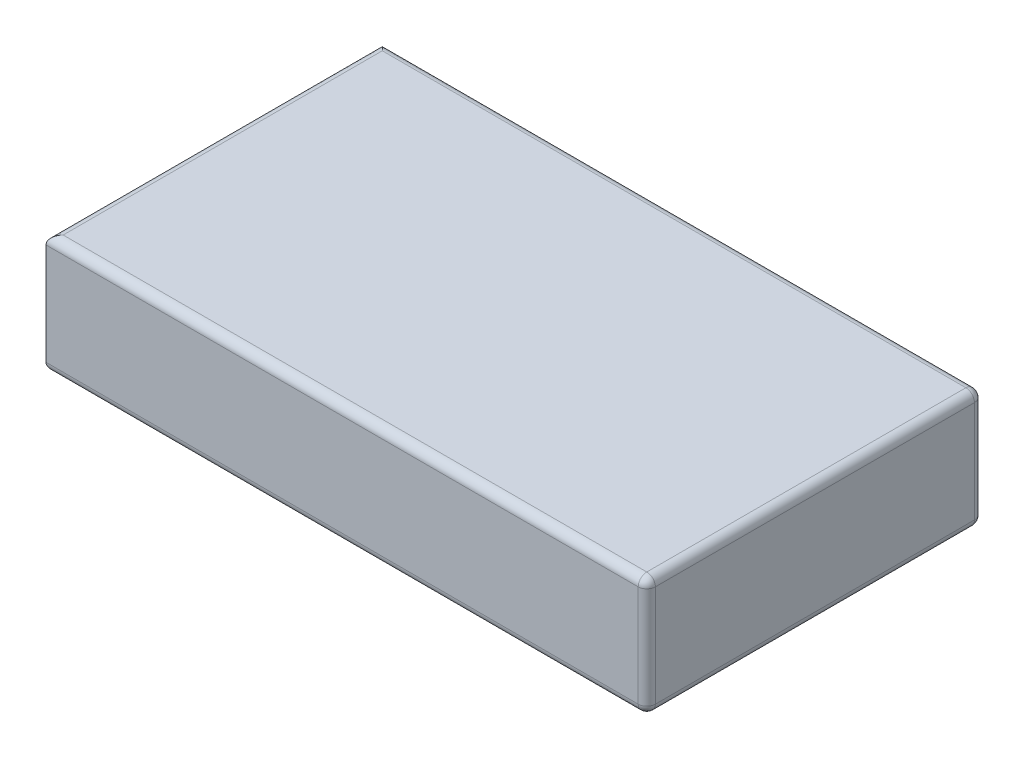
ISO-10303-21;
HEADER;
FILE_DESCRIPTION(('STEP AP214'),'2;1');
FILE_NAME('part.step','',(''),(''),'','','');
FILE_SCHEMA(('AUTOMOTIVE_DESIGN { 1 0 10303 214 1 1 1 1 }'));
ENDSEC;
DATA;
#1=APPLICATION_CONTEXT('core data for automotive mechanical design processes');
#2=APPLICATION_PROTOCOL_DEFINITION('international standard','automotive_design',2000,#1);
#3=PRODUCT_CONTEXT('',#1,'mechanical');
#4=PRODUCT('Part','Part','',(#3));
#5=PRODUCT_RELATED_PRODUCT_CATEGORY('part','',(#4));
#6=PRODUCT_DEFINITION_FORMATION('','',#4);
#7=PRODUCT_DEFINITION_CONTEXT('part definition',#1,'design');
#8=PRODUCT_DEFINITION('design','',#6,#7);
#9=PRODUCT_DEFINITION_SHAPE('','',#8);
#10=(LENGTH_UNIT() NAMED_UNIT(*) SI_UNIT(.MILLI.,.METRE.));
#11=(NAMED_UNIT(*) PLANE_ANGLE_UNIT() SI_UNIT($,.RADIAN.));
#12=(NAMED_UNIT(*) SI_UNIT($,.STERADIAN.) SOLID_ANGLE_UNIT());
#13=UNCERTAINTY_MEASURE_WITH_UNIT(LENGTH_MEASURE(1.E-05),#10,'distance_accuracy_value','');
#14=(GEOMETRIC_REPRESENTATION_CONTEXT(3) GLOBAL_UNCERTAINTY_ASSIGNED_CONTEXT((#13)) GLOBAL_UNIT_ASSIGNED_CONTEXT((#10,
#11,#12)) REPRESENTATION_CONTEXT('',''));
#15=CARTESIAN_POINT('',(0.,0.,0.));
#16=DIRECTION('',(0.,0.,1.));
#17=DIRECTION('',(1.,0.,0.));
#18=AXIS2_PLACEMENT_3D('',#15,#16,#17);
#19=CARTESIAN_POINT('',(35.,3.46,-9.795));
#20=DIRECTION('',(0.,0.,1.));
#21=DIRECTION('',(1.,0.,0.));
#22=AXIS2_PLACEMENT_3D('',#19,#20,#21);
#23=PLANE('',#22);
#24=DIRECTION('',(0.,1.,0.));
#25=VECTOR('',#24,1.);
#26=CARTESIAN_POINT('',(34.5,-3.46,-9.795));
#27=LINE('',#26,#25);
#28=CARTESIAN_POINT('',(34.5,2.96,-9.795));
#29=VERTEX_POINT('',#28);
#30=CARTESIAN_POINT('',(34.5,-2.96,-9.795));
#31=VERTEX_POINT('',#30);
#32=EDGE_CURVE('E128',#29,#31,#27,.F.);
#33=ORIENTED_EDGE('',*,*,#32,.T.);
#34=DIRECTION('',(-1.,0.,0.));
#35=VECTOR('',#34,1.);
#36=CARTESIAN_POINT('',(35.,-2.96,-9.795));
#37=LINE('',#36,#35);
#38=CARTESIAN_POINT('',(0.,-2.96,-9.795));
#39=VERTEX_POINT('',#38);
#40=EDGE_CURVE('E165',#31,#39,#37,.T.);
#41=ORIENTED_EDGE('',*,*,#40,.T.);
#42=DIRECTION('',(0.,1.,0.));
#43=VECTOR('',#42,1.);
#44=CARTESIAN_POINT('',(0.,3.46,-9.795));
#45=LINE('',#44,#43);
#46=CARTESIAN_POINT('',(0.,2.96,-9.795));
#47=VERTEX_POINT('',#46);
#48=EDGE_CURVE('E149',#39,#47,#45,.T.);
#49=ORIENTED_EDGE('',*,*,#48,.T.);
#50=DIRECTION('',(-1.,0.,0.));
#51=VECTOR('',#50,1.);
#52=CARTESIAN_POINT('',(35.,2.96,-9.795));
#53=LINE('',#52,#51);
#54=EDGE_CURVE('E162',#47,#29,#53,.F.);
#55=ORIENTED_EDGE('',*,*,#54,.T.);
#56=EDGE_LOOP('',(#33,#41,#49,#55));
#57=FACE_BOUND('',#56,.T.);
#58=ADVANCED_FACE('F34',(#57),#23,.F.);
#59=CARTESIAN_POINT('',(35.,3.46,9.795));
#60=DIRECTION('',(0.,-1.,0.));
#61=DIRECTION('',(0.,0.,-1.));
#62=AXIS2_PLACEMENT_3D('',#59,#60,#61);
#63=PLANE('',#62);
#64=DIRECTION('',(0.,0.,1.));
#65=VECTOR('',#64,1.);
#66=CARTESIAN_POINT('',(34.5,3.46,-9.795));
#67=LINE('',#66,#65);
#68=CARTESIAN_POINT('',(34.5,3.46,9.295));
#69=VERTEX_POINT('',#68);
#70=CARTESIAN_POINT('',(34.5,3.46,-9.295));
#71=VERTEX_POINT('',#70);
#72=EDGE_CURVE('E43',#69,#71,#67,.F.);
#73=ORIENTED_EDGE('',*,*,#72,.T.);
#74=DIRECTION('',(-1.,0.,0.));
#75=VECTOR('',#74,1.);
#76=CARTESIAN_POINT('',(35.,3.46,-9.295));
#77=LINE('',#76,#75);
#78=CARTESIAN_POINT('',(0.5,3.46,-9.295));
#79=VERTEX_POINT('',#78);
#80=EDGE_CURVE('E11',#71,#79,#77,.T.);
#81=ORIENTED_EDGE('',*,*,#80,.T.);
#82=DIRECTION('',(0.,0.,1.));
#83=VECTOR('',#82,1.);
#84=CARTESIAN_POINT('',(0.5,3.46,9.795));
#85=LINE('',#84,#83);
#86=CARTESIAN_POINT('',(0.5,3.46,9.295));
#87=VERTEX_POINT('',#86);
#88=EDGE_CURVE('E180',#79,#87,#85,.T.);
#89=ORIENTED_EDGE('',*,*,#88,.T.);
#90=DIRECTION('',(-1.,0.,0.));
#91=VECTOR('',#90,1.);
#92=CARTESIAN_POINT('',(35.,3.46,9.295));
#93=LINE('',#92,#91);
#94=EDGE_CURVE('E54',#87,#69,#93,.F.);
#95=ORIENTED_EDGE('',*,*,#94,.T.);
#96=EDGE_LOOP('',(#73,#81,#89,#95));
#97=FACE_BOUND('',#96,.T.);
#98=ADVANCED_FACE('F236',(#97),#63,.F.);
#99=CARTESIAN_POINT('',(35.,3.46,9.795));
#100=DIRECTION('',(0.,0.,-1.));
#101=DIRECTION('',(0.,1.,0.));
#102=AXIS2_PLACEMENT_3D('',#99,#100,#101);
#103=PLANE('',#102);
#104=DIRECTION('',(0.,-1.,0.));
#105=VECTOR('',#104,1.);
#106=CARTESIAN_POINT('',(0.,3.46,9.795));
#107=LINE('',#106,#105);
#108=CARTESIAN_POINT('',(0.,2.96,9.795));
#109=VERTEX_POINT('',#108);
#110=CARTESIAN_POINT('',(0.,-2.96,9.795));
#111=VERTEX_POINT('',#110);
#112=EDGE_CURVE('E146',#109,#111,#107,.T.);
#113=ORIENTED_EDGE('',*,*,#112,.T.);
#114=DIRECTION('',(-1.,0.,0.));
#115=VECTOR('',#114,1.);
#116=CARTESIAN_POINT('',(35.,-2.96,9.795));
#117=LINE('',#116,#115);
#118=CARTESIAN_POINT('',(34.5,-2.96,9.795));
#119=VERTEX_POINT('',#118);
#120=EDGE_CURVE('E160',#111,#119,#117,.F.);
#121=ORIENTED_EDGE('',*,*,#120,.T.);
#122=DIRECTION('',(0.,-1.,0.));
#123=VECTOR('',#122,1.);
#124=CARTESIAN_POINT('',(34.5,3.46,9.795));
#125=LINE('',#124,#123);
#126=CARTESIAN_POINT('',(34.5,2.96,9.795));
#127=VERTEX_POINT('',#126);
#128=EDGE_CURVE('E157',#119,#127,#125,.F.);
#129=ORIENTED_EDGE('',*,*,#128,.T.);
#130=DIRECTION('',(-1.,0.,0.));
#131=VECTOR('',#130,1.);
#132=CARTESIAN_POINT('',(35.,2.96,9.795));
#133=LINE('',#132,#131);
#134=EDGE_CURVE('E155',#127,#109,#133,.T.);
#135=ORIENTED_EDGE('',*,*,#134,.T.);
#136=EDGE_LOOP('',(#113,#121,#129,#135));
#137=FACE_BOUND('',#136,.T.);
#138=ADVANCED_FACE('F273',(#137),#103,.F.);
#139=CARTESIAN_POINT('',(35.,-3.46,9.795));
#140=DIRECTION('',(0.,1.,0.));
#141=DIRECTION('',(0.,0.,1.));
#142=AXIS2_PLACEMENT_3D('',#139,#140,#141);
#143=PLANE('',#142);
#144=DIRECTION('',(0.,0.,-1.));
#145=VECTOR('',#144,1.);
#146=CARTESIAN_POINT('',(34.5,-3.46,9.795));
#147=LINE('',#146,#145);
#148=CARTESIAN_POINT('',(34.5,-3.46,-9.295));
#149=VERTEX_POINT('',#148);
#150=CARTESIAN_POINT('',(34.5,-3.46,9.295));
#151=VERTEX_POINT('',#150);
#152=EDGE_CURVE('E171',#149,#151,#147,.F.);
#153=ORIENTED_EDGE('',*,*,#152,.T.);
#154=DIRECTION('',(-1.,0.,0.));
#155=VECTOR('',#154,1.);
#156=CARTESIAN_POINT('',(35.,-3.46,9.295));
#157=LINE('',#156,#155);
#158=CARTESIAN_POINT('',(0.5,-3.46,9.295));
#159=VERTEX_POINT('',#158);
#160=EDGE_CURVE('E173',#151,#159,#157,.T.);
#161=ORIENTED_EDGE('',*,*,#160,.T.);
#162=DIRECTION('',(0.,0.,-1.));
#163=VECTOR('',#162,1.);
#164=CARTESIAN_POINT('',(0.5,-3.46,9.795));
#165=LINE('',#164,#163);
#166=CARTESIAN_POINT('',(0.5,-3.46,-9.295));
#167=VERTEX_POINT('',#166);
#168=EDGE_CURVE('E167',#159,#167,#165,.T.);
#169=ORIENTED_EDGE('',*,*,#168,.T.);
#170=DIRECTION('',(-1.,0.,0.));
#171=VECTOR('',#170,1.);
#172=CARTESIAN_POINT('',(35.,-3.46,-9.295));
#173=LINE('',#172,#171);
#174=EDGE_CURVE('E169',#167,#149,#173,.F.);
#175=ORIENTED_EDGE('',*,*,#174,.T.);
#176=EDGE_LOOP('',(#153,#161,#169,#175));
#177=FACE_BOUND('',#176,.T.);
#178=ADVANCED_FACE('F278',(#177),#143,.F.);
#179=CARTESIAN_POINT('',(35.,0.,0.));
#180=DIRECTION('',(1.,0.,0.));
#181=DIRECTION('',(0.,0.,-1.));
#182=AXIS2_PLACEMENT_3D('',#179,#180,#181);
#183=PLANE('',#182);
#184=DIRECTION('',(0.,-1.,0.));
#185=VECTOR('',#184,1.);
#186=CARTESIAN_POINT('',(35.,-3.46,9.295));
#187=LINE('',#186,#185);
#188=CARTESIAN_POINT('',(35.,2.96,9.295));
#189=VERTEX_POINT('',#188);
#190=CARTESIAN_POINT('',(35.,-2.96,9.295));
#191=VERTEX_POINT('',#190);
#192=EDGE_CURVE('E121',#189,#191,#187,.T.);
#193=ORIENTED_EDGE('',*,*,#192,.T.);
#194=DIRECTION('',(0.,0.,-1.));
#195=VECTOR('',#194,1.);
#196=CARTESIAN_POINT('',(35.,-2.96,-9.795));
#197=LINE('',#196,#195);
#198=CARTESIAN_POINT('',(35.,-2.96,-9.295));
#199=VERTEX_POINT('',#198);
#200=EDGE_CURVE('E117',#191,#199,#197,.T.);
#201=ORIENTED_EDGE('',*,*,#200,.T.);
#202=DIRECTION('',(0.,1.,0.));
#203=VECTOR('',#202,1.);
#204=CARTESIAN_POINT('',(35.,3.46,-9.295));
#205=LINE('',#204,#203);
#206=CARTESIAN_POINT('',(35.,2.96,-9.295));
#207=VERTEX_POINT('',#206);
#208=EDGE_CURVE('E109',#199,#207,#205,.T.);
#209=ORIENTED_EDGE('',*,*,#208,.T.);
#210=DIRECTION('',(0.,0.,1.));
#211=VECTOR('',#210,1.);
#212=CARTESIAN_POINT('',(35.,2.96,9.795));
#213=LINE('',#212,#211);
#214=EDGE_CURVE('E114',#207,#189,#213,.T.);
#215=ORIENTED_EDGE('',*,*,#214,.T.);
#216=EDGE_LOOP('',(#193,#201,#209,#215));
#217=FACE_BOUND('',#216,.T.);
#218=ADVANCED_FACE('F112',(#217),#183,.T.);
#219=CARTESIAN_POINT('',(0.,0.,0.));
#220=DIRECTION('',(1.,0.,0.));
#221=DIRECTION('',(0.,0.,-1.));
#222=AXIS2_PLACEMENT_3D('',#219,#220,#221);
#223=PLANE('',#222);
#224=CARTESIAN_POINT('',(0.,0.,5.858));
#225=DIRECTION('',(-1.,0.,0.));
#226=DIRECTION('',(0.,0.,1.));
#227=AXIS2_PLACEMENT_3D('',#224,#225,#226);
#228=CIRCLE('',#227,2.16);
#229=CARTESIAN_POINT('',(0.,0.,8.018));
#230=VERTEX_POINT('',#229);
#231=EDGE_CURVE('E211',#230,#230,#228,.T.);
#232=ORIENTED_EDGE('',*,*,#231,.F.);
#233=EDGE_LOOP('',(#232));
#234=FACE_BOUND('',#233,.T.);
#235=CARTESIAN_POINT('',(0.,0.,-5.858));
#236=DIRECTION('',(-1.,0.,0.));
#237=DIRECTION('',(0.,0.,1.));
#238=AXIS2_PLACEMENT_3D('',#235,#236,#237);
#239=CIRCLE('',#238,2.16);
#240=CARTESIAN_POINT('',(0.,0.,-3.698));
#241=VERTEX_POINT('',#240);
#242=EDGE_CURVE('E221',#241,#241,#239,.T.);
#243=ORIENTED_EDGE('',*,*,#242,.F.);
#244=EDGE_LOOP('',(#243));
#245=FACE_BOUND('',#244,.T.);
#246=ORIENTED_EDGE('',*,*,#48,.F.);
#247=DIRECTION('',(0.,0.,-1.));
#248=VECTOR('',#247,1.);
#249=CARTESIAN_POINT('',(0.,-2.96,0.));
#250=LINE('',#249,#248);
#251=EDGE_CURVE('E178',#39,#111,#250,.F.);
#252=ORIENTED_EDGE('',*,*,#251,.T.);
#253=ORIENTED_EDGE('',*,*,#112,.F.);
#254=DIRECTION('',(0.,0.,1.));
#255=VECTOR('',#254,1.);
#256=CARTESIAN_POINT('',(0.,2.96,0.));
#257=LINE('',#256,#255);
#258=EDGE_CURVE('E176',#109,#47,#257,.F.);
#259=ORIENTED_EDGE('',*,*,#258,.T.);
#260=EDGE_LOOP('',(#246,#252,#253,#259));
#261=FACE_BOUND('',#260,.T.);
#262=ADVANCED_FACE('F271',(#234,#245,#261),#223,.F.);
#263=CARTESIAN_POINT('',(12.,0.,-5.858));
#264=DIRECTION('',(-1.,0.,0.));
#265=DIRECTION('',(0.,0.,1.));
#266=AXIS2_PLACEMENT_3D('',#263,#264,#265);
#267=CYLINDRICAL_SURFACE('',#266,2.16);
#268=CARTESIAN_POINT('',(12.,0.,-5.858));
#269=DIRECTION('',(-1.,0.,0.));
#270=DIRECTION('',(0.,0.,1.));
#271=AXIS2_PLACEMENT_3D('',#268,#269,#270);
#272=CIRCLE('',#271,2.16);
#273=CARTESIAN_POINT('',(12.,0.,-3.698));
#274=VERTEX_POINT('',#273);
#275=EDGE_CURVE('E224',#274,#274,#272,.T.);
#276=ORIENTED_EDGE('',*,*,#275,.F.);
#277=EDGE_LOOP('',(#276));
#278=FACE_BOUND('',#277,.T.);
#279=ORIENTED_EDGE('',*,*,#242,.T.);
#280=EDGE_LOOP('',(#279));
#281=FACE_BOUND('',#280,.T.);
#282=ADVANCED_FACE('F338',(#278,#281),#267,.F.);
#283=CARTESIAN_POINT('',(12.,0.,-5.858));
#284=DIRECTION('',(-1.,0.,0.));
#285=DIRECTION('',(0.,0.,1.));
#286=AXIS2_PLACEMENT_3D('',#283,#284,#285);
#287=PLANE('',#286);
#288=ORIENTED_EDGE('',*,*,#275,.T.);
#289=EDGE_LOOP('',(#288));
#290=FACE_BOUND('',#289,.T.);
#291=ADVANCED_FACE('F332',(#290),#287,.T.);
#292=CARTESIAN_POINT('',(12.,0.,5.858));
#293=DIRECTION('',(-1.,0.,0.));
#294=DIRECTION('',(0.,0.,1.));
#295=AXIS2_PLACEMENT_3D('',#292,#293,#294);
#296=CYLINDRICAL_SURFACE('',#295,2.16);
#297=CARTESIAN_POINT('',(12.,0.,5.858));
#298=DIRECTION('',(-1.,0.,0.));
#299=DIRECTION('',(0.,0.,1.));
#300=AXIS2_PLACEMENT_3D('',#297,#298,#299);
#301=CIRCLE('',#300,2.16);
#302=CARTESIAN_POINT('',(12.,0.,8.018));
#303=VERTEX_POINT('',#302);
#304=EDGE_CURVE('E216',#303,#303,#301,.T.);
#305=ORIENTED_EDGE('',*,*,#304,.F.);
#306=EDGE_LOOP('',(#305));
#307=FACE_BOUND('',#306,.T.);
#308=ORIENTED_EDGE('',*,*,#231,.T.);
#309=EDGE_LOOP('',(#308));
#310=FACE_BOUND('',#309,.T.);
#311=ADVANCED_FACE('F327',(#307,#310),#296,.F.);
#312=CARTESIAN_POINT('',(12.,0.,5.858));
#313=DIRECTION('',(-1.,0.,0.));
#314=DIRECTION('',(0.,0.,1.));
#315=AXIS2_PLACEMENT_3D('',#312,#313,#314);
#316=PLANE('',#315);
#317=ORIENTED_EDGE('',*,*,#304,.T.);
#318=EDGE_LOOP('',(#317));
#319=FACE_BOUND('',#318,.T.);
#320=ADVANCED_FACE('F323',(#319),#316,.T.);
#321=CARTESIAN_POINT('',(35.,2.96,-9.295));
#322=DIRECTION('',(-1.,0.,0.));
#323=DIRECTION('',(0.,0.,1.));
#324=AXIS2_PLACEMENT_3D('',#321,#322,#323);
#325=CYLINDRICAL_SURFACE('',#324,0.5);
#326=CARTESIAN_POINT('',(34.5,2.96,-9.295));
#327=DIRECTION('',(1.,0.,0.));
#328=DIRECTION('',(0.,0.,-1.));
#329=AXIS2_PLACEMENT_3D('',#326,#327,#328);
#330=CIRCLE('',#329,0.5);
#331=EDGE_CURVE('E132',#29,#71,#330,.T.);
#332=ORIENTED_EDGE('',*,*,#331,.F.);
#333=ORIENTED_EDGE('',*,*,#54,.F.);
#334=CARTESIAN_POINT('',(0.5,2.96,-9.295));
#335=DIRECTION('',(-0.707106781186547,0.,0.707106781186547));
#336=DIRECTION('',(0.707106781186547,0.,0.707106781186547));
#337=AXIS2_PLACEMENT_3D('',#334,#335,#336);
#338=ELLIPSE('',#337,0.707106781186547,0.5);
#339=EDGE_CURVE('E38',#79,#47,#338,.T.);
#340=ORIENTED_EDGE('',*,*,#339,.F.);
#341=ORIENTED_EDGE('',*,*,#80,.F.);
#342=EDGE_LOOP('',(#332,#333,#340,#341));
#343=FACE_BOUND('',#342,.T.);
#344=ADVANCED_FACE('F36',(#343),#325,.T.);
#345=CARTESIAN_POINT('',(34.5,0.,-9.295));
#346=DIRECTION('',(0.,-1.,0.));
#347=DIRECTION('',(0.,0.,-1.));
#348=AXIS2_PLACEMENT_3D('',#345,#346,#347);
#349=CYLINDRICAL_SURFACE('',#348,0.5);
#350=CARTESIAN_POINT('',(34.5,-2.96,-9.295));
#351=DIRECTION('',(0.,-1.,0.));
#352=DIRECTION('',(1.,0.,0.));
#353=AXIS2_PLACEMENT_3D('',#350,#351,#352);
#354=CIRCLE('',#353,0.5);
#355=EDGE_CURVE('E133',#31,#199,#354,.T.);
#356=ORIENTED_EDGE('',*,*,#355,.F.);
#357=ORIENTED_EDGE('',*,*,#32,.F.);
#358=CARTESIAN_POINT('',(34.5,2.96,-9.295));
#359=DIRECTION('',(0.,1.,0.));
#360=DIRECTION('',(0.,0.,1.));
#361=AXIS2_PLACEMENT_3D('',#358,#359,#360);
#362=CIRCLE('',#361,0.5);
#363=EDGE_CURVE('E125',#207,#29,#362,.T.);
#364=ORIENTED_EDGE('',*,*,#363,.F.);
#365=ORIENTED_EDGE('',*,*,#208,.F.);
#366=EDGE_LOOP('',(#356,#357,#364,#365));
#367=FACE_BOUND('',#366,.T.);
#368=ADVANCED_FACE('F127',(#367),#349,.T.);
#369=CARTESIAN_POINT('',(35.,-2.96,-9.295));
#370=DIRECTION('',(-1.,0.,0.));
#371=DIRECTION('',(0.,0.,1.));
#372=AXIS2_PLACEMENT_3D('',#369,#370,#371);
#373=CYLINDRICAL_SURFACE('',#372,0.5);
#374=CARTESIAN_POINT('',(0.5,-2.96,-9.295));
#375=DIRECTION('',(0.707106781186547,0.,-0.707106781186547));
#376=DIRECTION('',(-0.707106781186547,0.,-0.707106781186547));
#377=AXIS2_PLACEMENT_3D('',#374,#375,#376);
#378=ELLIPSE('',#377,0.707106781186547,0.5);
#379=EDGE_CURVE('E204',#39,#167,#378,.F.);
#380=ORIENTED_EDGE('',*,*,#379,.F.);
#381=ORIENTED_EDGE('',*,*,#40,.F.);
#382=CARTESIAN_POINT('',(34.5,-2.96,-9.295));
#383=DIRECTION('',(1.,0.,0.));
#384=DIRECTION('',(0.,0.,-1.));
#385=AXIS2_PLACEMENT_3D('',#382,#383,#384);
#386=CIRCLE('',#385,0.5);
#387=EDGE_CURVE('E207',#149,#31,#386,.T.);
#388=ORIENTED_EDGE('',*,*,#387,.F.);
#389=ORIENTED_EDGE('',*,*,#174,.F.);
#390=EDGE_LOOP('',(#380,#381,#388,#389));
#391=FACE_BOUND('',#390,.T.);
#392=ADVANCED_FACE('F263',(#391),#373,.T.);
#393=CARTESIAN_POINT('',(0.5,2.96,9.795));
#394=DIRECTION('',(0.,0.,1.));
#395=DIRECTION('',(1.,0.,0.));
#396=AXIS2_PLACEMENT_3D('',#393,#394,#395);
#397=CYLINDRICAL_SURFACE('',#396,0.5);
#398=ORIENTED_EDGE('',*,*,#339,.T.);
#399=ORIENTED_EDGE('',*,*,#258,.F.);
#400=CARTESIAN_POINT('',(0.5,2.96,9.295));
#401=DIRECTION('',(0.707106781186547,0.,0.707106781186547));
#402=DIRECTION('',(-0.707106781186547,0.,0.707106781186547));
#403=AXIS2_PLACEMENT_3D('',#400,#401,#402);
#404=ELLIPSE('',#403,0.707106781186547,0.5);
#405=EDGE_CURVE('E139',#87,#109,#404,.T.);
#406=ORIENTED_EDGE('',*,*,#405,.F.);
#407=ORIENTED_EDGE('',*,*,#88,.F.);
#408=EDGE_LOOP('',(#398,#399,#406,#407));
#409=FACE_BOUND('',#408,.T.);
#410=ADVANCED_FACE('F238',(#409),#397,.T.);
#411=CARTESIAN_POINT('',(34.5,2.96,-9.295));
#412=DIRECTION('',(0.,0.,1.));
#413=DIRECTION('',(1.,0.,0.));
#414=AXIS2_PLACEMENT_3D('',#411,#412,#413);
#415=SPHERICAL_SURFACE('',#414,0.5);
#416=ORIENTED_EDGE('',*,*,#363,.T.);
#417=ORIENTED_EDGE('',*,*,#331,.T.);
#418=CARTESIAN_POINT('',(34.5,2.96,-9.295));
#419=DIRECTION('',(0.,0.,-1.));
#420=DIRECTION('',(-1.,0.,0.));
#421=AXIS2_PLACEMENT_3D('',#418,#419,#420);
#422=CIRCLE('',#421,0.5);
#423=EDGE_CURVE('E136',#207,#71,#422,.F.);
#424=ORIENTED_EDGE('',*,*,#423,.F.);
#425=EDGE_LOOP('',(#416,#417,#424));
#426=FACE_BOUND('',#425,.T.);
#427=ADVANCED_FACE('F137',(#426),#415,.T.);
#428=CARTESIAN_POINT('',(34.5,-2.96,-9.295));
#429=DIRECTION('',(0.,0.,1.));
#430=DIRECTION('',(1.,0.,0.));
#431=AXIS2_PLACEMENT_3D('',#428,#429,#430);
#432=SPHERICAL_SURFACE('',#431,0.5);
#433=ORIENTED_EDGE('',*,*,#387,.T.);
#434=ORIENTED_EDGE('',*,*,#355,.T.);
#435=CARTESIAN_POINT('',(34.5,-2.96,-9.295));
#436=DIRECTION('',(0.,0.,-1.));
#437=DIRECTION('',(-1.,0.,0.));
#438=AXIS2_PLACEMENT_3D('',#435,#436,#437);
#439=CIRCLE('',#438,0.5);
#440=EDGE_CURVE('E140',#149,#199,#439,.F.);
#441=ORIENTED_EDGE('',*,*,#440,.F.);
#442=EDGE_LOOP('',(#433,#434,#441));
#443=FACE_BOUND('',#442,.T.);
#444=ADVANCED_FACE('F259',(#443),#432,.T.);
#445=CARTESIAN_POINT('',(0.5,-2.96,9.795));
#446=DIRECTION('',(0.,0.,-1.));
#447=DIRECTION('',(-1.,0.,0.));
#448=AXIS2_PLACEMENT_3D('',#445,#446,#447);
#449=CYLINDRICAL_SURFACE('',#448,0.5);
#450=ORIENTED_EDGE('',*,*,#379,.T.);
#451=ORIENTED_EDGE('',*,*,#168,.F.);
#452=CARTESIAN_POINT('',(0.5,-2.96,9.295));
#453=DIRECTION('',(-0.707106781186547,0.,-0.707106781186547));
#454=DIRECTION('',(0.707106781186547,0.,-0.707106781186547));
#455=AXIS2_PLACEMENT_3D('',#452,#453,#454);
#456=ELLIPSE('',#455,0.707106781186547,0.5);
#457=EDGE_CURVE('E198',#111,#159,#456,.F.);
#458=ORIENTED_EDGE('',*,*,#457,.F.);
#459=ORIENTED_EDGE('',*,*,#251,.F.);
#460=EDGE_LOOP('',(#450,#451,#458,#459));
#461=FACE_BOUND('',#460,.T.);
#462=ADVANCED_FACE('F268',(#461),#449,.T.);
#463=CARTESIAN_POINT('',(35.,2.96,9.295));
#464=DIRECTION('',(-1.,0.,0.));
#465=DIRECTION('',(0.,0.,1.));
#466=AXIS2_PLACEMENT_3D('',#463,#464,#465);
#467=CYLINDRICAL_SURFACE('',#466,0.5);
#468=ORIENTED_EDGE('',*,*,#405,.T.);
#469=ORIENTED_EDGE('',*,*,#134,.F.);
#470=CARTESIAN_POINT('',(34.5,2.96,9.295));
#471=DIRECTION('',(1.,0.,0.));
#472=DIRECTION('',(0.,0.,-1.));
#473=AXIS2_PLACEMENT_3D('',#470,#471,#472);
#474=CIRCLE('',#473,0.5);
#475=EDGE_CURVE('E195',#69,#127,#474,.T.);
#476=ORIENTED_EDGE('',*,*,#475,.F.);
#477=ORIENTED_EDGE('',*,*,#94,.F.);
#478=EDGE_LOOP('',(#468,#469,#476,#477));
#479=FACE_BOUND('',#478,.T.);
#480=ADVANCED_FACE('F242',(#479),#467,.T.);
#481=CARTESIAN_POINT('',(34.5,2.96,0.));
#482=DIRECTION('',(0.,0.,-1.));
#483=DIRECTION('',(-1.,0.,0.));
#484=AXIS2_PLACEMENT_3D('',#481,#482,#483);
#485=CYLINDRICAL_SURFACE('',#484,0.5);
#486=ORIENTED_EDGE('',*,*,#423,.T.);
#487=ORIENTED_EDGE('',*,*,#72,.F.);
#488=CARTESIAN_POINT('',(34.5,2.96,9.295));
#489=DIRECTION('',(0.,0.,1.));
#490=DIRECTION('',(1.,0.,0.));
#491=AXIS2_PLACEMENT_3D('',#488,#489,#490);
#492=CIRCLE('',#491,0.5);
#493=EDGE_CURVE('E144',#189,#69,#492,.T.);
#494=ORIENTED_EDGE('',*,*,#493,.F.);
#495=ORIENTED_EDGE('',*,*,#214,.F.);
#496=EDGE_LOOP('',(#486,#487,#494,#495));
#497=FACE_BOUND('',#496,.T.);
#498=ADVANCED_FACE('F142',(#497),#485,.T.);
#499=CARTESIAN_POINT('',(34.5,-2.96,0.));
#500=DIRECTION('',(0.,0.,1.));
#501=DIRECTION('',(1.,0.,0.));
#502=AXIS2_PLACEMENT_3D('',#499,#500,#501);
#503=CYLINDRICAL_SURFACE('',#502,0.5);
#504=ORIENTED_EDGE('',*,*,#440,.T.);
#505=ORIENTED_EDGE('',*,*,#200,.F.);
#506=CARTESIAN_POINT('',(34.5,-2.96,9.295));
#507=DIRECTION('',(0.,0.,1.));
#508=DIRECTION('',(1.,0.,0.));
#509=AXIS2_PLACEMENT_3D('',#506,#507,#508);
#510=CIRCLE('',#509,0.5);
#511=EDGE_CURVE('E191',#151,#191,#510,.T.);
#512=ORIENTED_EDGE('',*,*,#511,.F.);
#513=ORIENTED_EDGE('',*,*,#152,.F.);
#514=EDGE_LOOP('',(#504,#505,#512,#513));
#515=FACE_BOUND('',#514,.T.);
#516=ADVANCED_FACE('F256',(#515),#503,.T.);
#517=CARTESIAN_POINT('',(35.,-2.96,9.295));
#518=DIRECTION('',(-1.,0.,0.));
#519=DIRECTION('',(0.,0.,1.));
#520=AXIS2_PLACEMENT_3D('',#517,#518,#519);
#521=CYLINDRICAL_SURFACE('',#520,0.5);
#522=ORIENTED_EDGE('',*,*,#457,.T.);
#523=ORIENTED_EDGE('',*,*,#160,.F.);
#524=CARTESIAN_POINT('',(34.5,-2.96,9.295));
#525=DIRECTION('',(1.,0.,0.));
#526=DIRECTION('',(0.,0.,-1.));
#527=AXIS2_PLACEMENT_3D('',#524,#525,#526);
#528=CIRCLE('',#527,0.5);
#529=EDGE_CURVE('E188',#119,#151,#528,.T.);
#530=ORIENTED_EDGE('',*,*,#529,.F.);
#531=ORIENTED_EDGE('',*,*,#120,.F.);
#532=EDGE_LOOP('',(#522,#523,#530,#531));
#533=FACE_BOUND('',#532,.T.);
#534=ADVANCED_FACE('F276',(#533),#521,.T.);
#535=CARTESIAN_POINT('',(34.5,2.96,9.295));
#536=DIRECTION('',(0.,0.,1.));
#537=DIRECTION('',(1.,0.,0.));
#538=AXIS2_PLACEMENT_3D('',#535,#536,#537);
#539=SPHERICAL_SURFACE('',#538,0.5);
#540=ORIENTED_EDGE('',*,*,#493,.T.);
#541=ORIENTED_EDGE('',*,*,#475,.T.);
#542=CARTESIAN_POINT('',(34.5,2.96,9.295));
#543=DIRECTION('',(0.,1.,0.));
#544=DIRECTION('',(0.,0.,1.));
#545=AXIS2_PLACEMENT_3D('',#542,#543,#544);
#546=CIRCLE('',#545,0.5);
#547=EDGE_CURVE('E186',#189,#127,#546,.F.);
#548=ORIENTED_EDGE('',*,*,#547,.F.);
#549=EDGE_LOOP('',(#540,#541,#548));
#550=FACE_BOUND('',#549,.T.);
#551=ADVANCED_FACE('F244',(#550),#539,.T.);
#552=CARTESIAN_POINT('',(34.5,-2.96,9.295));
#553=DIRECTION('',(0.,0.,1.));
#554=DIRECTION('',(1.,0.,0.));
#555=AXIS2_PLACEMENT_3D('',#552,#553,#554);
#556=SPHERICAL_SURFACE('',#555,0.5);
#557=ORIENTED_EDGE('',*,*,#529,.T.);
#558=ORIENTED_EDGE('',*,*,#511,.T.);
#559=CARTESIAN_POINT('',(34.5,-2.96,9.295));
#560=DIRECTION('',(0.,-1.,0.));
#561=DIRECTION('',(0.,0.,-1.));
#562=AXIS2_PLACEMENT_3D('',#559,#560,#561);
#563=CIRCLE('',#562,0.5);
#564=EDGE_CURVE('E184',#119,#191,#563,.F.);
#565=ORIENTED_EDGE('',*,*,#564,.F.);
#566=EDGE_LOOP('',(#557,#558,#565));
#567=FACE_BOUND('',#566,.T.);
#568=ADVANCED_FACE('F252',(#567),#556,.T.);
#569=CARTESIAN_POINT('',(34.5,0.,9.295));
#570=DIRECTION('',(0.,1.,0.));
#571=DIRECTION('',(0.,0.,1.));
#572=AXIS2_PLACEMENT_3D('',#569,#570,#571);
#573=CYLINDRICAL_SURFACE('',#572,0.5);
#574=ORIENTED_EDGE('',*,*,#547,.T.);
#575=ORIENTED_EDGE('',*,*,#128,.F.);
#576=ORIENTED_EDGE('',*,*,#564,.T.);
#577=ORIENTED_EDGE('',*,*,#192,.F.);
#578=EDGE_LOOP('',(#574,#575,#576,#577));
#579=FACE_BOUND('',#578,.T.);
#580=ADVANCED_FACE('F248',(#579),#573,.T.);
#581=CLOSED_SHELL('',(#58,#98,#138,#178,#218,#262,#282,#291,#311,#320,#344,#368,#392,#410,#427,
#444,#462,#480,#498,#516,#534,#551,#568,#580));
#582=MANIFOLD_SOLID_BREP('B2',#581);
#583=ADVANCED_BREP_SHAPE_REPRESENTATION('',(#18,#582),#14);
#584=SHAPE_DEFINITION_REPRESENTATION(#9,#583);
ENDSEC;
END-ISO-10303-21;
